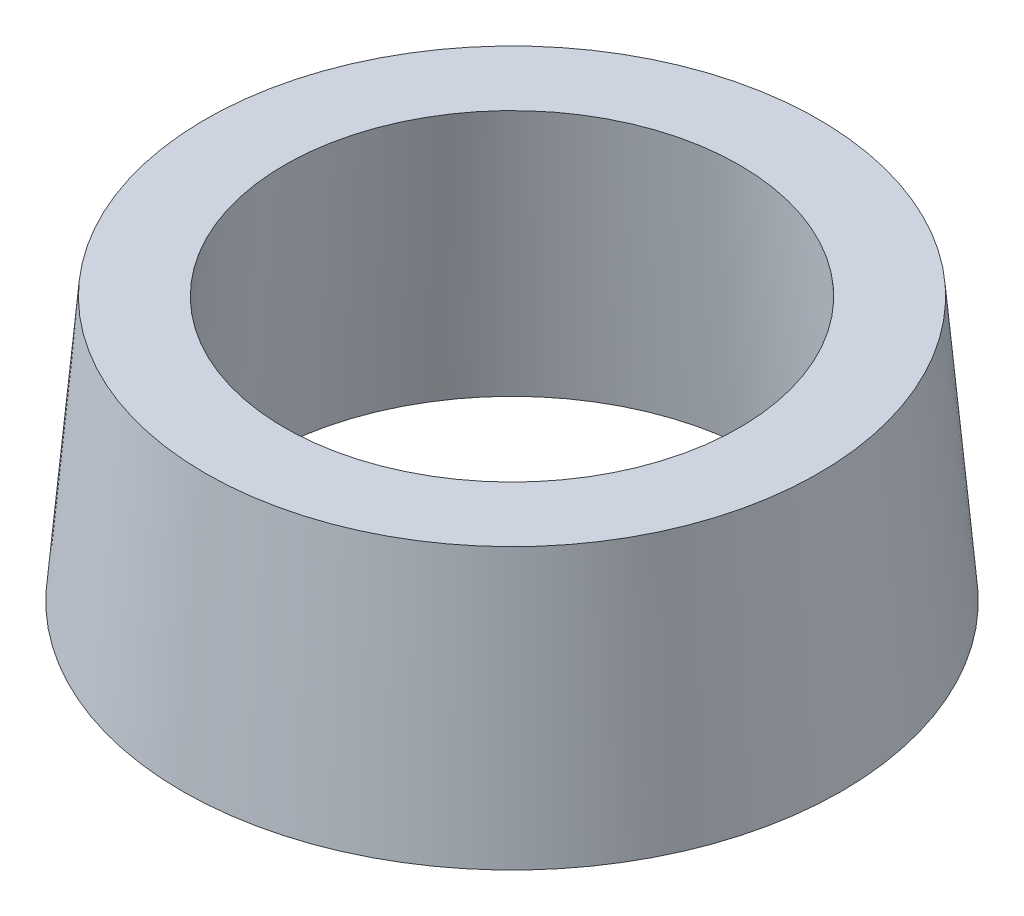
from build123d import *

# Parameters (mm, degrees)
ESQUISSE2_R             = 6.25
BOSS_EXTRU_1_DEPTH      = 5
BOSS_EXTRU_1_TAPER      = 5
ESQUISSE3_R             = 4.75
ENL_V_MAT_EXTRU_1_DEPTH = 5
ENL_V_MAT_EXTRU_1_DRAFT = -5


with BuildPart() as part:
    # Esquisse2 → Boss.-Extru.1 (new body)
    with BuildSketch(Plane(origin=(0, 0, 0), x_dir=(1, 0, 0), z_dir=(0, 1, 0))):
        Circle(ESQUISSE2_R)
    extrude(amount=BOSS_EXTRU_1_DEPTH, taper=BOSS_EXTRU_1_TAPER)


with BuildPart() as enl_v_mat_extru_1_tool:
    # Esquisse3 → Enl_v. mat.-Extru.1 (with draft: the straight prism first)
    with BuildSketch(Plane.XZ):
        Circle(ESQUISSE3_R)
    extrude(amount=-ENL_V_MAT_EXTRU_1_DEPTH)
    # Enl_v. mat.-Extru.1: the draft: its side faces are tilted about the plane it starts from
    enl_v_mat_extru_1_sides = [enl_v_mat_extru_1_tool.faces().sort_by_distance(p)[0] for p in [
        (-4.75, 2.5, 0),
    ]]
    draft(enl_v_mat_extru_1_sides, Plane.XZ, ENL_V_MAT_EXTRU_1_DRAFT)


with BuildPart() as part_1:
    add(part.part)

    # Enl_v. mat.-Extru.1: cut by enl_v_mat_extru_1_tool
    add(enl_v_mat_extru_1_tool.part, mode=Mode.SUBTRACT)


solid = part_1.part
